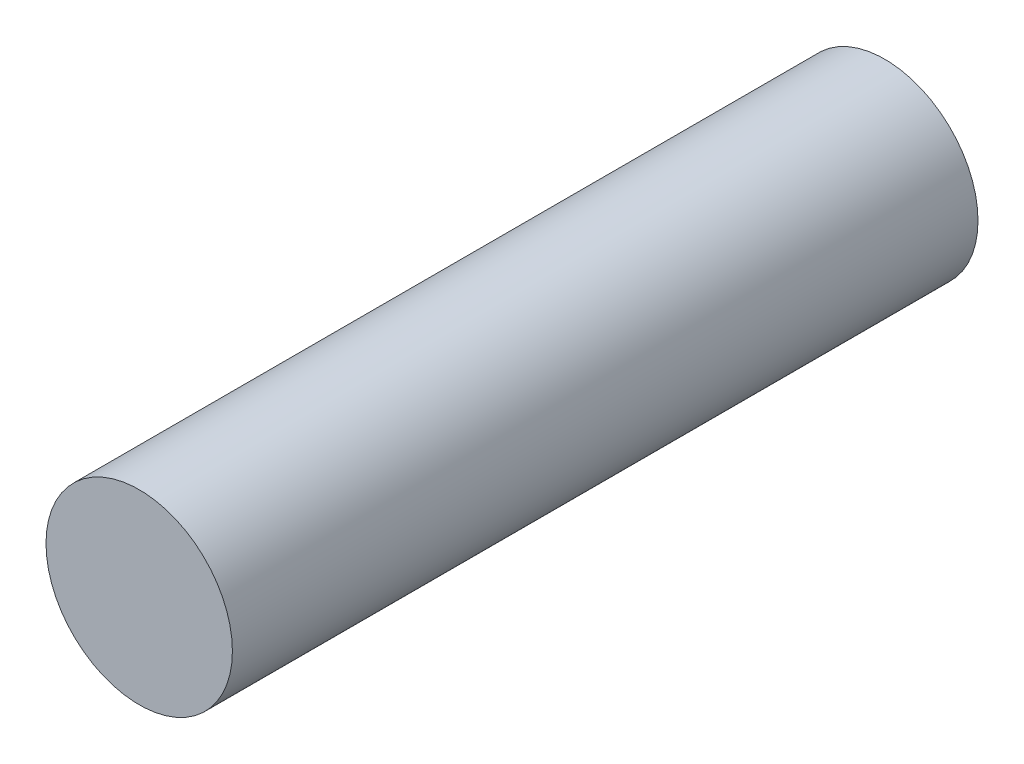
from build123d import *

# Parameters (mm, degrees)
SKETCH1_R          = 4.7625
BASE_EXTRUDE_DEPTH = 38.1


with BuildPart() as part:
    # Sketch1 → Base-Extrude (new body)
    with BuildSketch(Plane.XY):
        with Locations(Location((0, 0, 0), (0, 0, 180))):
            Circle(SKETCH1_R)
    extrude(amount=BASE_EXTRUDE_DEPTH)


solid = part.part
